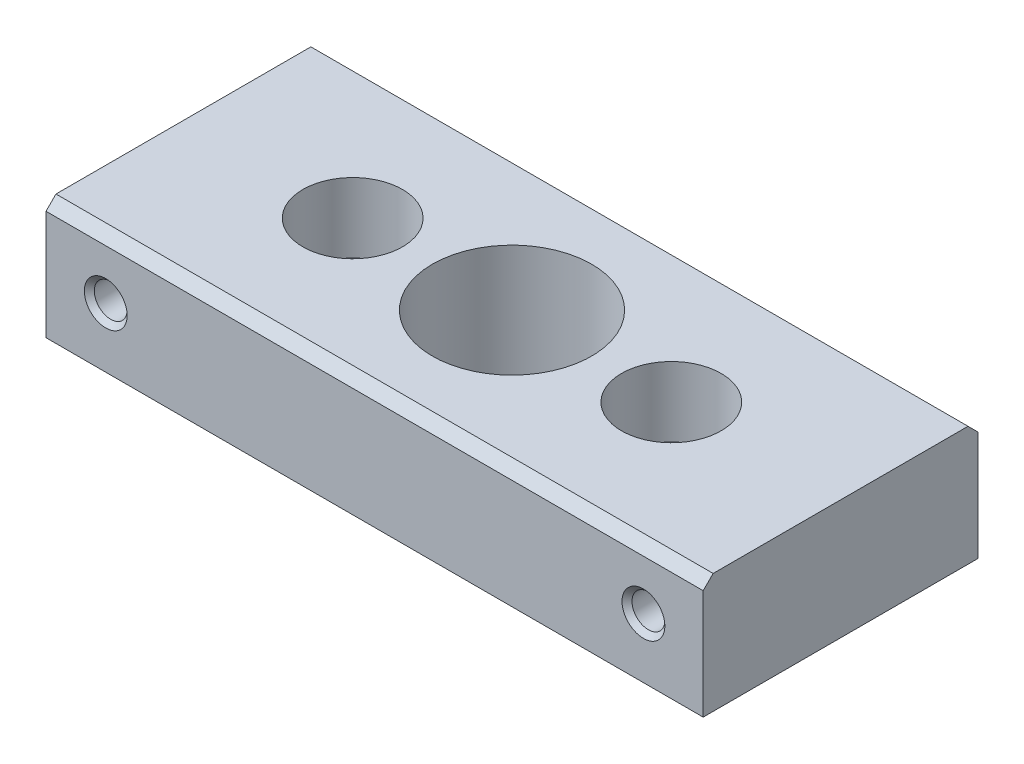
from build123d import *

# Parameters (mm, degrees)
SKETCH_1_W            = 66
SKETCH_1_H            = 12
EXTRUDE_1_DEPTH       = 27.6
SKETCH_2_R            = 8
SKETCH_2_R_2          = 3
CUT_EXTRUDE_1_DEPTH   = 45.662736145
SKETCH_3_R            = 5
CUT_EXTRUDE_2_DEPTH   = 7
HOLE_WIZARD_M41_D     = 3.3
HOLE_WIZARD_M41_DEPTH = 15
HOLE_WIZARD_M41_TIP   = 0.991420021
HOLE_WIZARD_M42_D     = 3.3
HOLE_WIZARD_M42_DEPTH = 15
HOLE_WIZARD_M42_TIP   = 0.991420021
CHAMFER_1_SIZE        = 0.5
CHAMFER_2_SIZE        = 1


with BuildPart() as part:
    # Sketch 1 → Extrude 1 (new body)
    with BuildSketch(Plane.XY):
        with Locations((0, 6)):
            Rectangle(SKETCH_1_W, SKETCH_1_H)
    extrude(amount=-EXTRUDE_1_DEPTH)

    # Sketch 2 → Cut-Extrude 1 (cut, through all)
    with BuildSketch(Plane(origin=(0, 12, 0), x_dir=(1, 0, 0), z_dir=(0, 1, 0))):
        with Locations(Location((0, 13.8, 0), (0, 0, 180))):
            Circle(SKETCH_2_R)
        with Locations(Location((-16, 13.8, 0), (0, 0, 180))):
            Circle(SKETCH_2_R_2)
        with Locations(Location((16, 13.8, 0), (0, 0, 180))):
            Circle(SKETCH_2_R_2)
    extrude(amount=-CUT_EXTRUDE_1_DEPTH, mode=Mode.SUBTRACT)

    # Sketch 3 → Cut-Extrude 2 (cut)
    with BuildSketch(Plane(origin=(0, 12, 0), x_dir=(1, 0, 0), z_dir=(0, 1, 0))):
        with Locations(Location((-16, 13.8, 0), (0, 0, 180))):
            Circle(SKETCH_3_R)
        with Locations(Location((16, 13.8, 0), (0, 0, 180))):
            Circle(SKETCH_3_R)
    extrude(amount=-CUT_EXTRUDE_2_DEPTH, mode=Mode.SUBTRACT)

    # Hole Wizard M41
    with Locations(Plane.XY):
        with Locations((-27, 6), (27, 6)):
            Hole(HOLE_WIZARD_M41_D / 2, depth=HOLE_WIZARD_M41_DEPTH)
            with Locations((0, 0, -(HOLE_WIZARD_M41_DEPTH + HOLE_WIZARD_M41_TIP / 2))):  # 118° drill point
                Cone(0, HOLE_WIZARD_M41_D / 2, HOLE_WIZARD_M41_TIP, mode=Mode.SUBTRACT)

    # Hole Wizard M42
    with Locations(Plane(origin=(0, 0, -27.6), x_dir=(-1, 0, 0), z_dir=(0, 0, -1))):
        with Locations((27, 6), (-27, 6)):
            Hole(HOLE_WIZARD_M42_D / 2, depth=HOLE_WIZARD_M42_DEPTH)
            with Locations((0, 0, -(HOLE_WIZARD_M42_DEPTH + HOLE_WIZARD_M42_TIP / 2))):  # 118° drill point
                Cone(0, HOLE_WIZARD_M42_D / 2, HOLE_WIZARD_M42_TIP, mode=Mode.SUBTRACT)

    # Chamfer 1
    chamfer_1_edges = [part.edges().sort_by_distance(p)[0] for p in [
        (28.65, 6, 0),
        (-25.35, 6, 0),
        (25.35, 6, -27.6),
        (-28.65, 6, -27.6),
    ]]
    chamfer(chamfer_1_edges, length=CHAMFER_1_SIZE)

    # Chamfer 2
    chamfer_2_edges = [part.edges().sort_by_distance(p)[0] for p in [
        (0, 12, -27.6),
        (0, 12, 0),
    ]]
    chamfer(chamfer_2_edges, length=CHAMFER_2_SIZE)


solid = part.part
